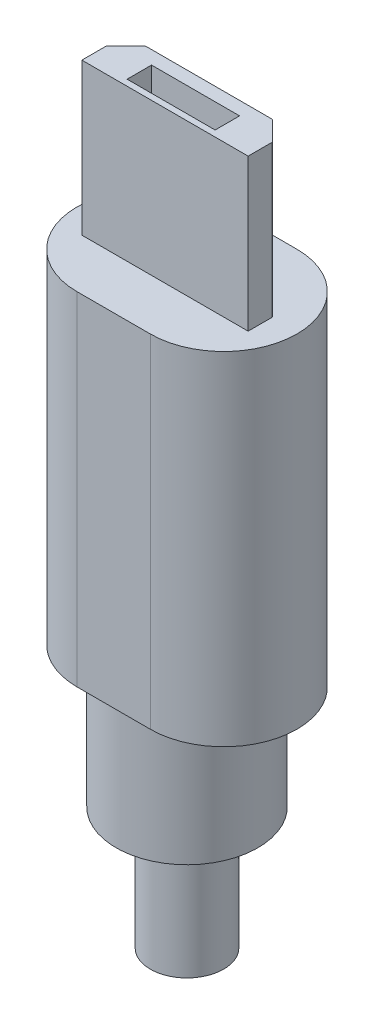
from build123d import *

# Parameters (mm, degrees)
EXTRUDE_1_DEPTH     = 14
SKETCH_2_R          = 2.9
EXTRUDE_2_DEPTH     = 5
EXTRUDE_3_DEPTH     = 6.2
SKETCH_5_W          = 3.6
SKETCH_5_H          = 1
CUT_EXTRUDE_1_DEPTH = 4
FILLET_1_R          = 0.1
SKETCH_6_R          = 1.5
EXTRUDE_4_DEPTH     = 5
CUT_EXTRUDE_2_DEPTH = 0.1


with BuildPart() as part:
    # Sketch 1 → Extrude 1 (new body)
    with BuildSketch(Plane(origin=(0, 0, 0), x_dir=(1, 0, 0), z_dir=(0, 1, 0))):
        with BuildLine():
            Line((-1.5, 3), (1.5, 3))
            ThreePointArc((1.5, 3), (4.5, 0), (1.5, -3))
            Line((1.5, -3), (-1.5, -3))
            ThreePointArc((-1.5, -3), (-4.5, 0), (-1.5, 3))
        make_face()
    extrude(amount=EXTRUDE_1_DEPTH)

    # Sketch 2 → Extrude 2 (add)
    with BuildSketch(Plane.XZ):
        with Locations(Location((0, 0, 0), (0, 0, 270))):
            Circle(SKETCH_2_R)
    extrude(amount=EXTRUDE_2_DEPTH)

    # Sketch 3 → Extrude 3 (add)
    with BuildSketch(Plane(origin=(0, 14, 0), x_dir=(1, 0, 0), z_dir=(0, 1, 0))):
        Polygon((-3.4, 0.1), (-2.6, 0.9), (2.6, 0.9), (3.4, 0.1), (3.4, -0.9), (-3.4, -0.9), align=None)
    extrude(amount=EXTRUDE_3_DEPTH)

    # Sketch 5 → Cut-Extrude 1 (cut)
    with BuildSketch(Plane(origin=(0, 20.2, 0), x_dir=(1, 0, 0), z_dir=(0, 1, 0))):
        with Locations((0, -0.15)):
            Rectangle(SKETCH_5_W, SKETCH_5_H)
    extrude(amount=-CUT_EXTRUDE_1_DEPTH, mode=Mode.SUBTRACT)

    # Fillet 1
    fillet_1_edges = [part.edges().sort_by_distance(p)[0] for p in [
        (3.4, 17.1, -0.1),
        (2.6, 17.1, -0.9),
        (-2.6, 17.1, -0.9),
        (-3.4, 17.1, -0.1),
    ]]
    fillet(fillet_1_edges, radius=FILLET_1_R)

    # Sketch 6 → Extrude 4 (add)
    with BuildSketch(Plane.XZ.offset(5)):
        with Locations(Location((0, 0, 0), (0, 0, 270))):
            Circle(SKETCH_6_R)
    extrude(amount=EXTRUDE_4_DEPTH)

    # Sketch 8 → Cut-Extrude 2 (cut)
    with BuildSketch(Plane(origin=(0, 0, -3), x_dir=(-1, 0, 0), z_dir=(0, 0, -1))):
        with BuildLine():
            Line((0, 11.52960021), (-0.716956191, 10.8097184))
            Line((-0.716956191, 10.8097184), (-0.127, 10.8097184))
            Line((-0.127, 10.8097184), (-0.127, 5.401898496))
            ThreePointArc((-0.127, 5.401898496), (-0.156162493, 5.355937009), (-0.21016765, 5.362745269))
            Line((-0.21016765, 5.362745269), (-1.120514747, 6.115321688))
            ThreePointArc((-1.120514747, 6.115321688), (-1.324422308, 6.378057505), (-1.397, 6.702620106))
            Line((-1.397, 6.702620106), (-1.397, 7.963089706))
            ThreePointArc((-1.397, 7.963089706), (-1.524, 8.962958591), (-1.651, 7.963089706))
            Line((-1.651, 7.963089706), (-1.651, 6.722530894))
            ThreePointArc((-1.651, 6.722530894), (-1.550201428, 6.271766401), (-1.267007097, 5.906869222))
            Line((-1.267007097, 5.906869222), (-0.219161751, 5.040624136))
            ThreePointArc((-0.219161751, 5.040624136), (-0.151192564, 4.953045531), (-0.127, 4.844857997))
            Line((-0.127, 4.844857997), (-0.127, 3.56953501))
            ThreePointArc((-0.127, 3.56953501), (0, 2.312364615), (0.127, 3.56953501))
            Line((0.127, 3.56953501), (0.127, 5.933535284))
            ThreePointArc((0.127, 5.933535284), (0.139930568, 6.013544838), (0.177405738, 6.08540818))
            Line((0.177405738, 6.08540818), (1.053118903, 7.259351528))
            ThreePointArc((1.053118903, 7.259351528), (1.165544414, 7.474941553), (1.204336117, 7.714970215))
            Line((1.204336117, 7.714970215), (1.204336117, 8.518458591))
            Line((1.204336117, 8.518458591), (1.524, 8.518458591))
            Line((1.524, 8.518458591), (1.524, 9.407458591))
            Line((1.524, 9.407458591), (0.635, 9.407458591))
            Line((0.635, 9.407458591), (0.635, 8.518458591))
            Line((0.635, 8.518458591), (0.954663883, 8.518458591))
            Line((0.954663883, 8.518458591), (0.954663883, 7.798383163))
            ThreePointArc((0.954663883, 7.798383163), (0.915872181, 7.558354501), (0.80344667, 7.342764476))
            Line((0.80344667, 7.342764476), (0.218518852, 6.558635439))
            ThreePointArc((0.218518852, 6.558635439), (0.161798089, 6.540796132), (0.127, 6.589010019))
            Line((0.127, 6.589010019), (0.127, 10.8097184))
            Line((0.127, 10.8097184), (0.716956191, 10.8097184))
            Line((0.716956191, 10.8097184), (0, 11.52960021))
        make_face()
    extrude(amount=-CUT_EXTRUDE_2_DEPTH, mode=Mode.SUBTRACT)


solid = part.part
